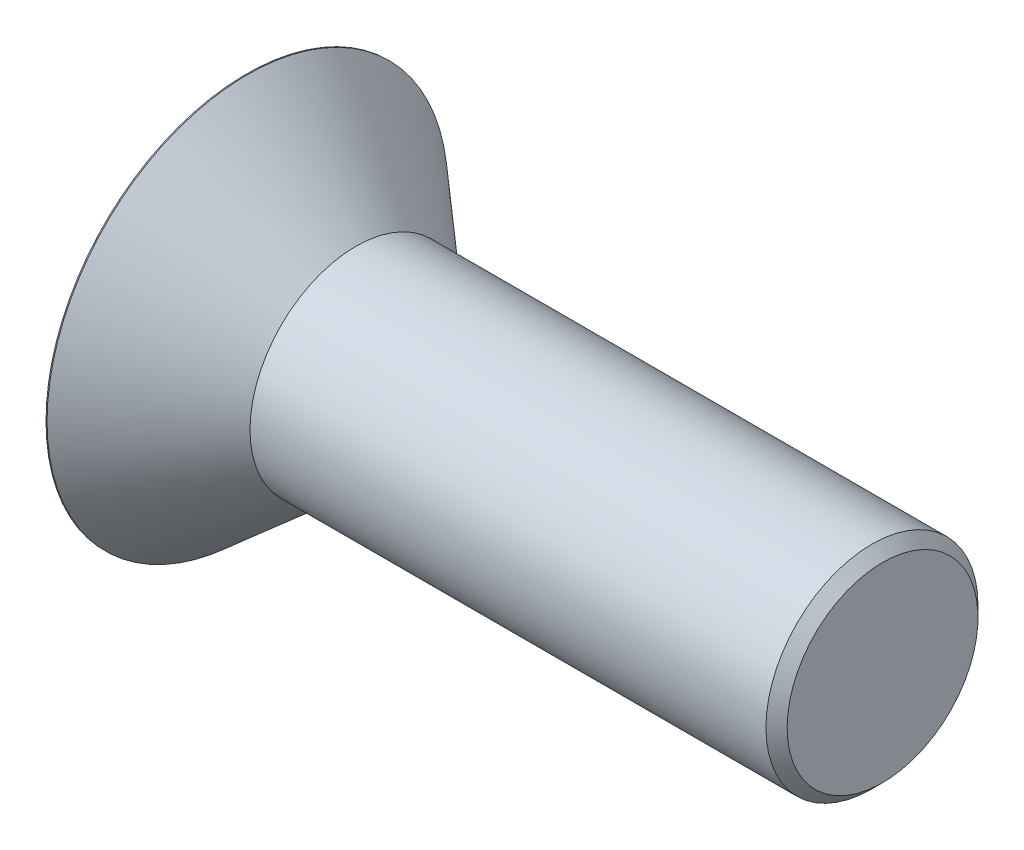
from build123d import *

# Parameters (mm, degrees)
HEX_2_DEPTH = 7.5438


with BuildPart() as part:
    # BodySke → BaseBody (revolve)
    with BuildSketch(Plane.XY, mode=Mode.PRIVATE) as basebody_sk:
        Polygon((0, 0), (0, 24.003), (0.127, 24.003), (13.129614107, 12.7), (74.93, 12.7), (76.2, 11.43), (76.2, 0), align=None)
    revolve(basebody_sk.sketch.rotate(Axis((0, 0, 0), (1, 0, 0)), 90), axis=Axis((0, 0, 0), (1, 0, 0)))

    # Sketch2 → PreBroach (revolve, cut)
    with BuildSketch(Plane.XY, mode=Mode.PRIVATE) as prebroach_sk:
        Polygon((0, 7.9375), (7.5438, 7.9375), (12.126517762, 0), (0, 0), align=None)
    revolve(prebroach_sk.sketch.rotate(Axis((0, 0, 0), (1, 0, 0)), 90), axis=Axis((0, 0, 0), (1, 0, 0)), mode=Mode.SUBTRACT)

    # Sketch3 → Hex 2 (cut)
    with BuildSketch(Plane.ZY):
        Polygon((-7.9375, -4.582717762), (-7.9375, 4.582717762), (0, 9.165435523), (7.9375, 4.582717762), (7.9375, -4.582717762), (0, -9.165435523), align=None)
    extrude(amount=-HEX_2_DEPTH, mode=Mode.SUBTRACT)


solid = part.part
